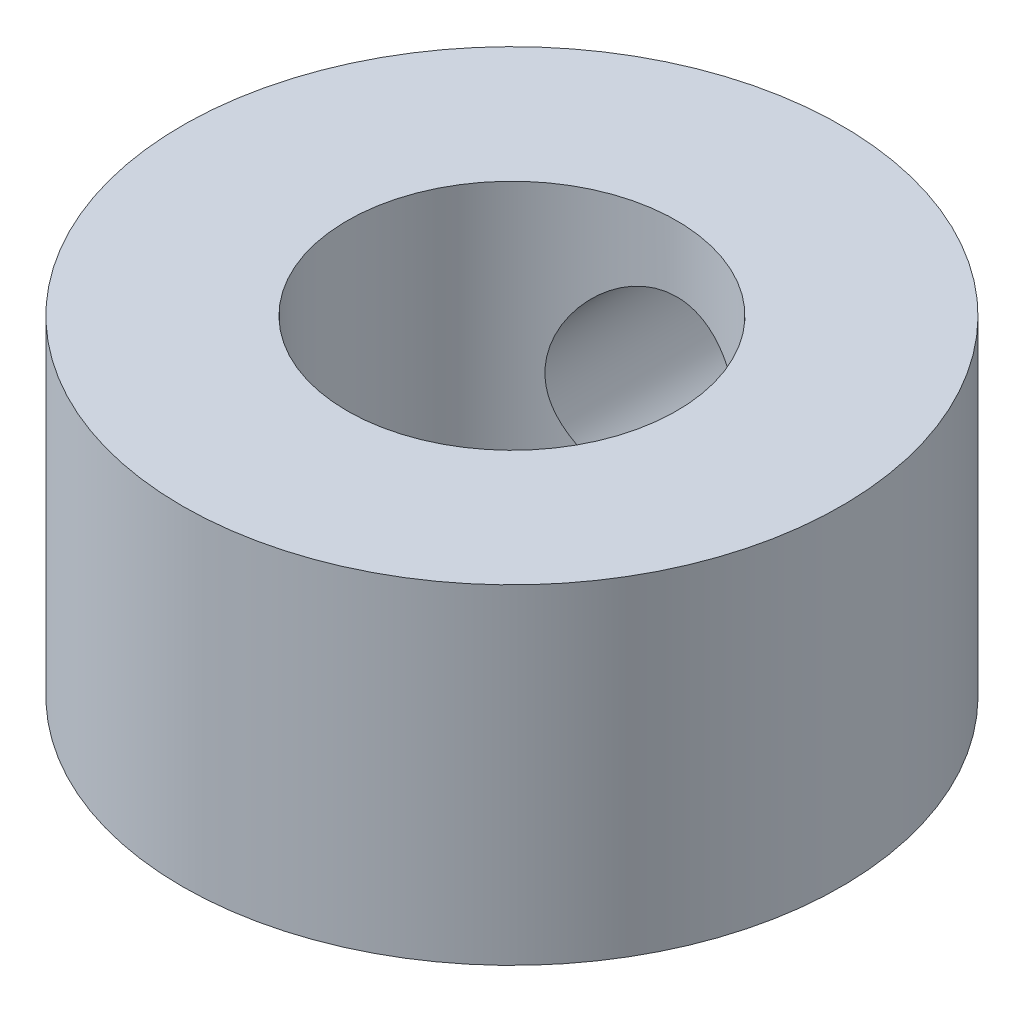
from build123d import *

# Parameters (mm, degrees)
ESQUISSE1_R             = 5
ESQUISSE1_R_2           = 2.5
BOSS_EXTRU_1_DEPTH      = 5
ESQUISSE4_R             = 1.5
ENL_V_MAT_EXTRU_2_DEPTH = 9.660254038


with BuildPart() as part:
    # Esquisse1 → Boss.-Extru.1 (new body)
    with BuildSketch(Plane(origin=(0, 0, 0), x_dir=(1, 0, 0), z_dir=(0, 1, 0))):
        with Locations(Location((0, 0, 0), (0, 0, 270))):
            Circle(ESQUISSE1_R)
        with Locations(Location((0, 0, 0), (0, 0, 270))):
            Circle(ESQUISSE1_R_2, mode=Mode.SUBTRACT)
    extrude(amount=BOSS_EXTRU_1_DEPTH)

    # Esquisse4 → Enl_v. mat.-Extru.2 (cut, through all)
    with BuildSketch(Plane.XY):
        with Locations(Location((0, 2.5, 0), (0, 0, 90))):
            Circle(ESQUISSE4_R)
    extrude(amount=-ENL_V_MAT_EXTRU_2_DEPTH, mode=Mode.SUBTRACT)


solid = part.part
